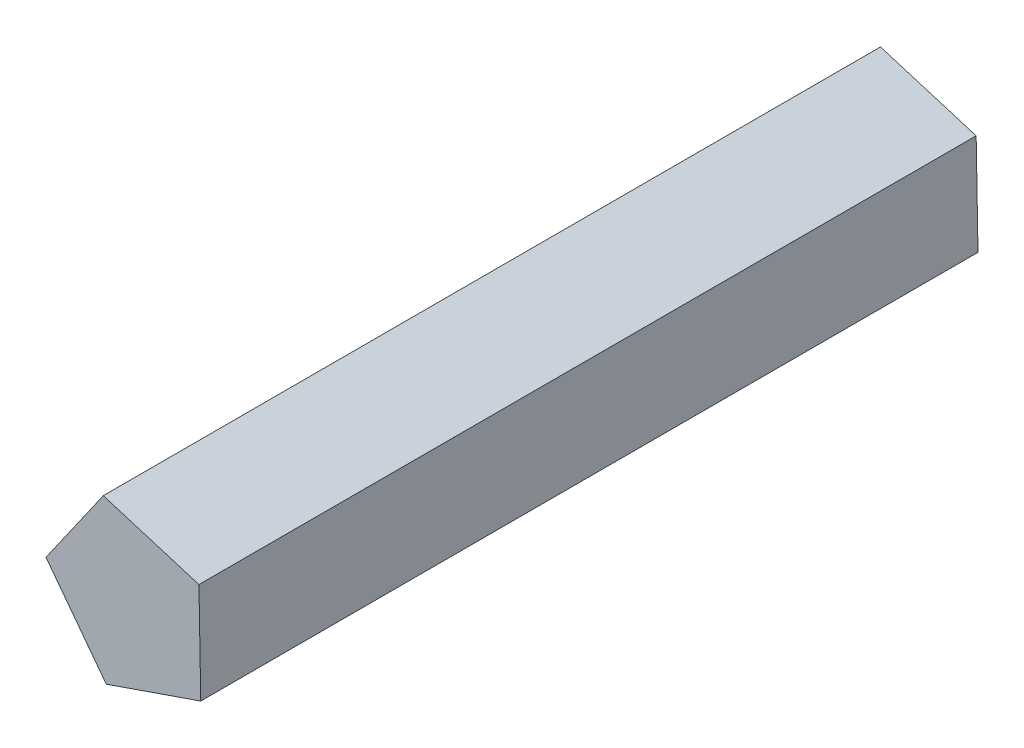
ISO-10303-21;
HEADER;
FILE_DESCRIPTION(('STEP AP214'),'2;1');
FILE_NAME('part.step','',(''),(''),'','','');
FILE_SCHEMA(('AUTOMOTIVE_DESIGN { 1 0 10303 214 1 1 1 1 }'));
ENDSEC;
DATA;
#1=APPLICATION_CONTEXT('core data for automotive mechanical design processes');
#2=APPLICATION_PROTOCOL_DEFINITION('international standard','automotive_design',2000,#1);
#3=PRODUCT_CONTEXT('',#1,'mechanical');
#4=PRODUCT('Part','Part','',(#3));
#5=PRODUCT_RELATED_PRODUCT_CATEGORY('part','',(#4));
#6=PRODUCT_DEFINITION_FORMATION('','',#4);
#7=PRODUCT_DEFINITION_CONTEXT('part definition',#1,'design');
#8=PRODUCT_DEFINITION('design','',#6,#7);
#9=PRODUCT_DEFINITION_SHAPE('','',#8);
#10=(LENGTH_UNIT() NAMED_UNIT(*) SI_UNIT(.MILLI.,.METRE.));
#11=(NAMED_UNIT(*) PLANE_ANGLE_UNIT() SI_UNIT($,.RADIAN.));
#12=(NAMED_UNIT(*) SI_UNIT($,.STERADIAN.) SOLID_ANGLE_UNIT());
#13=UNCERTAINTY_MEASURE_WITH_UNIT(LENGTH_MEASURE(1.E-05),#10,'distance_accuracy_value','');
#14=(GEOMETRIC_REPRESENTATION_CONTEXT(3) GLOBAL_UNCERTAINTY_ASSIGNED_CONTEXT((#13)) GLOBAL_UNIT_ASSIGNED_CONTEXT((#10,
#11,#12)) REPRESENTATION_CONTEXT('',''));
#15=CARTESIAN_POINT('',(0.,0.,0.));
#16=DIRECTION('',(0.,0.,1.));
#17=DIRECTION('',(1.,0.,0.));
#18=AXIS2_PLACEMENT_3D('',#15,#16,#17);
#19=CARTESIAN_POINT('',(11.1353373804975,1.24619270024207,24.));
#20=DIRECTION('',(-0.326477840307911,0.945204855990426,0.));
#21=DIRECTION('',(-0.945204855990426,-0.326477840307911,0.));
#22=AXIS2_PLACEMENT_3D('',#19,#20,#21);
#23=PLANE('',#22);
#24=DIRECTION('',(0.945204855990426,0.326477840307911,0.));
#25=VECTOR('',#24,1.);
#26=CARTESIAN_POINT('',(11.1353373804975,1.24619270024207,0.));
#27=LINE('',#26,#25);
#28=CARTESIAN_POINT('',(11.1353373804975,1.24619270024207,0.));
#29=VERTEX_POINT('',#28);
#30=CARTESIAN_POINT('',(14.053946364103,2.25429285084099,0.));
#31=VERTEX_POINT('',#30);
#32=EDGE_CURVE('E118',#29,#31,#27,.T.);
#33=ORIENTED_EDGE('',*,*,#32,.T.);
#34=DIRECTION('',(0.,0.,-1.));
#35=VECTOR('',#34,1.);
#36=CARTESIAN_POINT('',(14.053946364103,2.25429285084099,24.));
#37=LINE('',#36,#35);
#38=CARTESIAN_POINT('',(14.053946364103,2.25429285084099,24.));
#39=VERTEX_POINT('',#38);
#40=EDGE_CURVE('E11',#39,#31,#37,.T.);
#41=ORIENTED_EDGE('',*,*,#40,.F.);
#42=DIRECTION('',(0.945204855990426,0.326477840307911,0.));
#43=VECTOR('',#42,1.);
#44=CARTESIAN_POINT('',(11.1353373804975,1.24619270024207,24.));
#45=LINE('',#44,#43);
#46=CARTESIAN_POINT('',(11.1353373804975,1.24619270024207,24.));
#47=VERTEX_POINT('',#46);
#48=EDGE_CURVE('E131',#47,#39,#45,.T.);
#49=ORIENTED_EDGE('',*,*,#48,.F.);
#50=DIRECTION('',(0.,0.,-1.));
#51=VECTOR('',#50,1.);
#52=CARTESIAN_POINT('',(11.1353373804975,1.24619270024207,24.));
#53=LINE('',#52,#51);
#54=EDGE_CURVE('E114',#47,#29,#53,.T.);
#55=ORIENTED_EDGE('',*,*,#54,.T.);
#56=EDGE_LOOP('',(#33,#41,#49,#55));
#57=FACE_BOUND('',#56,.T.);
#58=ADVANCED_FACE('F39',(#57),#23,.F.);
#59=CARTESIAN_POINT('',(14.053946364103,2.25429285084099,24.));
#60=DIRECTION('',(-0.999830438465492,-0.0184145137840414,0.));
#61=DIRECTION('',(0.0184145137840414,-0.999830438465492,0.));
#62=AXIS2_PLACEMENT_3D('',#59,#60,#61);
#63=PLANE('',#62);
#64=DIRECTION('',(-0.0184145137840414,0.999830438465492,0.));
#65=VECTOR('',#64,1.);
#66=CARTESIAN_POINT('',(14.053946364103,2.25429285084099,0.));
#67=LINE('',#66,#65);
#68=CARTESIAN_POINT('',(13.9970859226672,5.34157502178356,0.));
#69=VERTEX_POINT('',#68);
#70=EDGE_CURVE('E122',#31,#69,#67,.T.);
#71=ORIENTED_EDGE('',*,*,#70,.T.);
#72=DIRECTION('',(0.,0.,-1.));
#73=VECTOR('',#72,1.);
#74=CARTESIAN_POINT('',(13.9970859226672,5.34157502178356,24.));
#75=LINE('',#74,#73);
#76=CARTESIAN_POINT('',(13.9970859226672,5.34157502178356,24.));
#77=VERTEX_POINT('',#76);
#78=EDGE_CURVE('E48',#77,#69,#75,.T.);
#79=ORIENTED_EDGE('',*,*,#78,.F.);
#80=DIRECTION('',(-0.0184145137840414,0.999830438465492,0.));
#81=VECTOR('',#80,1.);
#82=CARTESIAN_POINT('',(14.053946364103,2.25429285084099,24.));
#83=LINE('',#82,#81);
#84=EDGE_CURVE('E90',#39,#77,#83,.T.);
#85=ORIENTED_EDGE('',*,*,#84,.F.);
#86=ORIENTED_EDGE('',*,*,#40,.T.);
#87=EDGE_LOOP('',(#71,#79,#85,#86));
#88=FACE_BOUND('',#87,.T.);
#89=ADVANCED_FACE('F153',(#88),#63,.F.);
#90=CARTESIAN_POINT('',(13.9970859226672,5.34157502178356,24.));
#91=DIRECTION('',(-0.291451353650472,-0.956585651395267,0.));
#92=DIRECTION('',(0.956585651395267,-0.291451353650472,0.));
#93=AXIS2_PLACEMENT_3D('',#90,#91,#92);
#94=PLANE('',#93);
#95=DIRECTION('',(-0.956585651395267,0.291451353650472,0.));
#96=VECTOR('',#95,1.);
#97=CARTESIAN_POINT('',(13.9970859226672,5.34157502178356,0.));
#98=LINE('',#97,#96);
#99=CARTESIAN_POINT('',(11.0433352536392,6.2415201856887,0.));
#100=VERTEX_POINT('',#99);
#101=EDGE_CURVE('E106',#69,#100,#98,.T.);
#102=ORIENTED_EDGE('',*,*,#101,.T.);
#103=DIRECTION('',(0.,0.,-1.));
#104=VECTOR('',#103,1.);
#105=CARTESIAN_POINT('',(11.0433352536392,6.2415201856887,24.));
#106=LINE('',#105,#104);
#107=CARTESIAN_POINT('',(11.0433352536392,6.2415201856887,24.));
#108=VERTEX_POINT('',#107);
#109=EDGE_CURVE('E103',#108,#100,#106,.T.);
#110=ORIENTED_EDGE('',*,*,#109,.F.);
#111=DIRECTION('',(-0.956585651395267,0.291451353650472,0.));
#112=VECTOR('',#111,1.);
#113=CARTESIAN_POINT('',(13.9970859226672,5.34157502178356,24.));
#114=LINE('',#113,#112);
#115=EDGE_CURVE('E94',#77,#108,#114,.T.);
#116=ORIENTED_EDGE('',*,*,#115,.F.);
#117=ORIENTED_EDGE('',*,*,#78,.T.);
#118=EDGE_LOOP('',(#102,#110,#116,#117));
#119=FACE_BOUND('',#118,.T.);
#120=ADVANCED_FACE('F104',(#119),#94,.F.);
#121=CARTESIAN_POINT('',(11.0433352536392,6.2415201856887,24.));
#122=DIRECTION('',(0.819703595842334,-0.572787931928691,0.));
#123=DIRECTION('',(0.572787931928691,0.819703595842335,0.));
#124=AXIS2_PLACEMENT_3D('',#121,#122,#123);
#125=PLANE('',#124);
#126=DIRECTION('',(-0.572787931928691,-0.819703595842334,0.));
#127=VECTOR('',#126,1.);
#128=CARTESIAN_POINT('',(11.0433352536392,6.2415201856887,0.));
#129=LINE('',#128,#127);
#130=CARTESIAN_POINT('',(9.27467738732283,3.71043471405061,0.));
#131=VERTEX_POINT('',#130);
#132=EDGE_CURVE('E76',#100,#131,#129,.T.);
#133=ORIENTED_EDGE('',*,*,#132,.T.);
#134=DIRECTION('',(0.,0.,-1.));
#135=VECTOR('',#134,1.);
#136=CARTESIAN_POINT('',(9.27467738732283,3.71043471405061,24.));
#137=LINE('',#136,#135);
#138=CARTESIAN_POINT('',(9.27467738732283,3.71043471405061,24.));
#139=VERTEX_POINT('',#138);
#140=EDGE_CURVE('E108',#139,#131,#137,.T.);
#141=ORIENTED_EDGE('',*,*,#140,.F.);
#142=DIRECTION('',(-0.572787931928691,-0.819703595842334,0.));
#143=VECTOR('',#142,1.);
#144=CARTESIAN_POINT('',(11.0433352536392,6.2415201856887,24.));
#145=LINE('',#144,#143);
#146=EDGE_CURVE('E98',#108,#139,#145,.T.);
#147=ORIENTED_EDGE('',*,*,#146,.F.);
#148=ORIENTED_EDGE('',*,*,#109,.T.);
#149=EDGE_LOOP('',(#133,#141,#147,#148));
#150=FACE_BOUND('',#149,.T.);
#151=ADVANCED_FACE('F110',(#150),#125,.F.);
#152=CARTESIAN_POINT('',(9.27467738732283,3.71043471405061,24.));
#153=DIRECTION('',(0.798056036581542,0.602583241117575,0.));
#154=DIRECTION('',(-0.602583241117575,0.798056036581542,0.));
#155=AXIS2_PLACEMENT_3D('',#152,#153,#154);
#156=PLANE('',#155);
#157=DIRECTION('',(0.602583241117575,-0.798056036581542,0.));
#158=VECTOR('',#157,1.);
#159=CARTESIAN_POINT('',(9.27467738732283,3.71043471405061,0.));
#160=LINE('',#159,#158);
#161=EDGE_CURVE('E82',#131,#29,#160,.T.);
#162=ORIENTED_EDGE('',*,*,#161,.T.);
#163=ORIENTED_EDGE('',*,*,#54,.F.);
#164=DIRECTION('',(0.602583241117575,-0.798056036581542,0.));
#165=VECTOR('',#164,1.);
#166=CARTESIAN_POINT('',(9.27467738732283,3.71043471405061,24.));
#167=LINE('',#166,#165);
#168=EDGE_CURVE('E56',#139,#47,#167,.T.);
#169=ORIENTED_EDGE('',*,*,#168,.F.);
#170=ORIENTED_EDGE('',*,*,#140,.T.);
#171=EDGE_LOOP('',(#162,#163,#169,#170));
#172=FACE_BOUND('',#171,.T.);
#173=ADVANCED_FACE('F142',(#172),#156,.F.);
#174=CARTESIAN_POINT('',(0.,0.,24.));
#175=DIRECTION('',(0.,0.,1.));
#176=DIRECTION('',(1.,0.,0.));
#177=AXIS2_PLACEMENT_3D('',#174,#175,#176);
#178=PLANE('',#177);
#179=ORIENTED_EDGE('',*,*,#48,.T.);
#180=ORIENTED_EDGE('',*,*,#84,.T.);
#181=ORIENTED_EDGE('',*,*,#115,.T.);
#182=ORIENTED_EDGE('',*,*,#146,.T.);
#183=ORIENTED_EDGE('',*,*,#168,.T.);
#184=EDGE_LOOP('',(#179,#180,#181,#182,#183));
#185=FACE_BOUND('',#184,.T.);
#186=ADVANCED_FACE('F96',(#185),#178,.T.);
#187=CARTESIAN_POINT('',(0.,0.,0.));
#188=DIRECTION('',(0.,0.,1.));
#189=DIRECTION('',(1.,0.,0.));
#190=AXIS2_PLACEMENT_3D('',#187,#188,#189);
#191=PLANE('',#190);
#192=ORIENTED_EDGE('',*,*,#32,.F.);
#193=ORIENTED_EDGE('',*,*,#161,.F.);
#194=ORIENTED_EDGE('',*,*,#132,.F.);
#195=ORIENTED_EDGE('',*,*,#101,.F.);
#196=ORIENTED_EDGE('',*,*,#70,.F.);
#197=EDGE_LOOP('',(#192,#193,#194,#195,#196));
#198=FACE_BOUND('',#197,.T.);
#199=ADVANCED_FACE('F138',(#198),#191,.F.);
#200=CLOSED_SHELL('',(#58,#89,#120,#151,#173,#186,#199));
#201=MANIFOLD_SOLID_BREP('B2',#200);
#202=ADVANCED_BREP_SHAPE_REPRESENTATION('',(#18,#201),#14);
#203=SHAPE_DEFINITION_REPRESENTATION(#9,#202);
ENDSEC;
END-ISO-10303-21;
